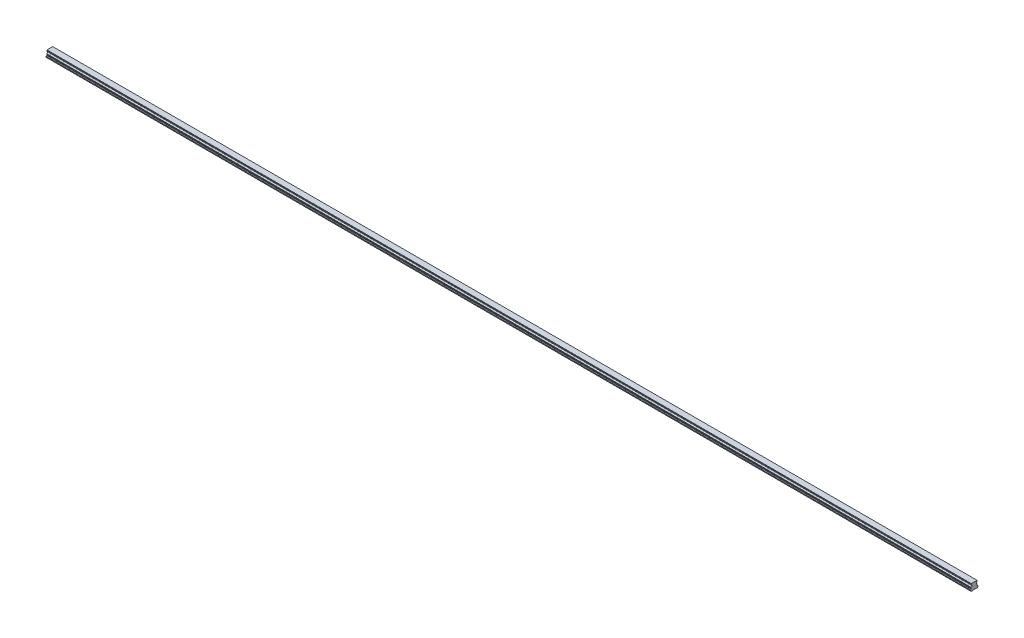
from build123d import *

# Parameters (mm, degrees)
BOSS_EXTRUDE1_DEPTH        = 3000
SKETCH3_R                  = 3
SKETCH3_R_2                = 2.5
CUT_EXTRUDE3_DEPTH         = 12
SKETCH3_2_R                = 2.5
CUT_EXTRUDE4_DEPTH         = 15
CHAMFER1_SIZE              = 0.5
LPATTERN4_COUNT            = 50
LPATTERN4_PITCH            = 60
CHAMFER1_OF_LPATTERN4_SIZE = 0.5


with BuildPart() as part:
    # Sketch1 → Boss-Extrude1 (new body)
    with BuildSketch(Plane(origin=(0, 0, 0), x_dir=(0, 0, -1), z_dir=(1, 0, 0))):
        with BuildLine():
            Line((9.375, 21.8), (-9.375, 21.8))
            Line((-9.375, 21.8), (-9.375, 20.756))
            Line((-9.375, 20.756), (-10, 19.415683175))
            Line((-10, 19.415683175), (-10, 17.685449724))
            ThreePointArc((-10, 17.685449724), (-7.2, 14.6), (-10, 11.514550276))
            Line((-10, 11.514550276), (-10, 9.784316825))
            Line((-10, 9.784316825), (-9.375, 8.444))
            Line((-9.375, 8.444), (-9.922688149, 6.4))
            Line((-9.922688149, 6.4), (-12.5, 5.489338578))
            Line((-12.5, 5.489338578), (-12.5, 2.65))
            Line((-12.5, 2.65), (-9.85, 0))
            Line((-9.85, 0), (-5.5, 0))
            Line((-5.5, 0), (-5, 0.5))
            Line((-5, 0.5), (5, 0.5))
            Line((5, 0.5), (5.5, 0))
            Line((5.5, 0), (9.85, 0))
            Line((9.85, 0), (12.5, 2.65))
            Line((12.5, 2.65), (12.5, 5.489338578))
            Line((12.5, 5.489338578), (9.922688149, 6.4))
            Line((9.922688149, 6.4), (9.375, 8.444))
            Line((9.375, 8.444), (10, 9.784316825))
            Line((10, 9.784316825), (10, 11.514550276))
            ThreePointArc((10, 11.514550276), (7.2, 14.6), (10, 17.685449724))
            Line((10, 17.685449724), (10, 19.415683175))
            Line((10, 19.415683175), (9.375, 20.756))
            Line((9.375, 20.756), (9.375, 21.8))
        make_face()
    extrude(amount=BOSS_EXTRUDE1_DEPTH)

    # Sketch3 → Cut-Extrude3 (cut)
    with BuildSketch(Plane.XZ):
        with Locations(Location((30, 0, 0), (0, 0, 270))):
            Circle(SKETCH3_R)
        with Locations(Location((30, 0, 0), (0, 0, 270))):
            Circle(SKETCH3_R_2, mode=Mode.SUBTRACT)
    cut_extrude3 = extrude(amount=-CUT_EXTRUDE3_DEPTH, mode=Mode.SUBTRACT)

    # Sketch3_2 → Cut-Extrude4 (cut)
    with BuildSketch(Plane.XZ):
        with Locations(Location((30, 0, 0), (0, 0, 270))):
            Circle(SKETCH3_2_R)
    cut_extrude4 = extrude(amount=-CUT_EXTRUDE4_DEPTH, mode=Mode.SUBTRACT)

    # Cut-Extrude5 cone 1 section (on through the dimple's axis) → Cut-Extrude5 (revolve, cut)
    with BuildSketch(Plane(origin=(30, 15, 0), x_dir=(0, 0, -1), z_dir=(1, 0, 0))):
        Polygon((0, 0), (2.5, 0), (0, 1.443375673), align=None)
    cut_extrude5 = revolve(axis=Axis((30, 15, 0), (0, 1, 0)), mode=Mode.SUBTRACT)

    # Chamfer1
    chamfer1_edges = [part.edges().sort_by_distance(p)[0] for p in [
        (30, 0.5, 3),
    ]]
    chamfer(chamfer1_edges, length=CHAMFER1_SIZE)

    # LPattern4: Cut-Extrude3, Cut-Extrude4, Cut-Extrude5 ×50
    with Locations(*[(i * LPATTERN4_PITCH, 0, 0) for i in range(1, LPATTERN4_COUNT)]):
        add(cut_extrude3, mode=Mode.SUBTRACT)
        add(cut_extrude4, mode=Mode.SUBTRACT)
        add(cut_extrude5, mode=Mode.SUBTRACT)

    # Chamfer1 of LPattern4
    chamfer1_of_lpattern4_edges = [part.edges().sort_by_distance(p)[0] for p in [
        (90, 0.5, 3),
        (150, 0.5, 3),
        (210, 0.5, 3),
        (270, 0.5, 3),
        (330, 0.5, 3),
        (390, 0.5, 3),
        (450, 0.5, 3),
        (510, 0.5, 3),
        (570, 0.5, 3),
        (630, 0.5, 3),
        (690, 0.5, 3),
        (750, 0.5, 3),
        (810, 0.5, 3),
        (870, 0.5, 3),
        (930, 0.5, 3),
        (990, 0.5, 3),
        (1050, 0.5, 3),
        (1110, 0.5, 3),
        (1170, 0.5, 3),
        (1230, 0.5, 3),
        (1290, 0.5, 3),
        (1350, 0.5, 3),
        (1410, 0.5, 3),
        (1470, 0.5, 3),
        (1530, 0.5, 3),
        (1590, 0.5, 3),
        (1650, 0.5, 3),
        (1710, 0.5, 3),
        (1770, 0.5, 3),
        (1830, 0.5, 3),
        (1890, 0.5, 3),
        (1950, 0.5, 3),
        (2010, 0.5, 3),
        (2070, 0.5, 3),
        (2130, 0.5, 3),
        (2190, 0.5, 3),
        (2250, 0.5, 3),
        (2310, 0.5, 3),
        (2370, 0.5, 3),
        (2430, 0.5, 3),
        (2490, 0.5, 3),
        (2550, 0.5, 3),
        (2610, 0.5, 3),
        (2670, 0.5, 3),
        (2730, 0.5, 3),
        (2790, 0.5, 3),
        (2850, 0.5, 3),
        (2910, 0.5, 3),
        (2970, 0.5, 3),
    ]]
    chamfer(chamfer1_of_lpattern4_edges, length=CHAMFER1_OF_LPATTERN4_SIZE)


solid = part.part
